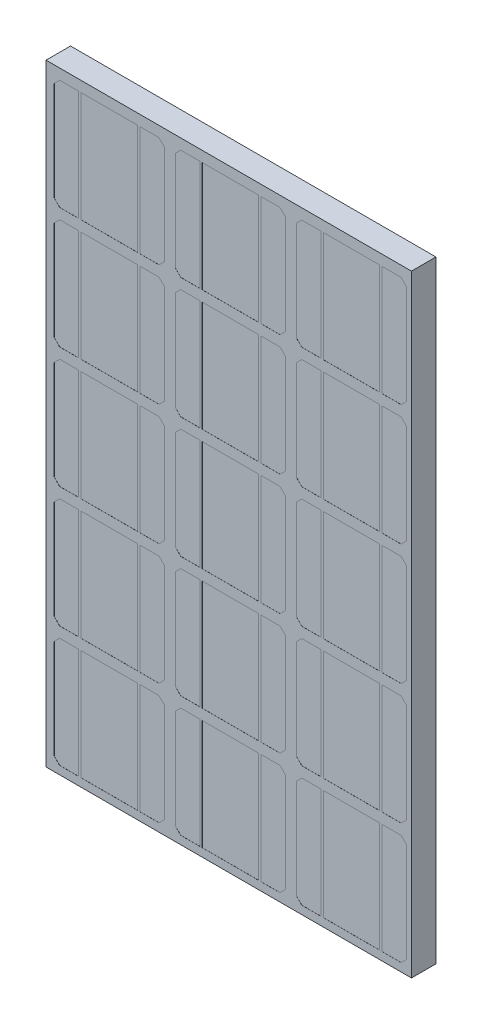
from build123d import *

# Parameters (mm, degrees)
ESQUISSE1_W             = 600
ESQUISSE1_H             = 750
BOSS_EXTRU_1_DEPTH      = 30
ESQUISSE2_W             = 69
ESQUISSE2_H             = 135
ENL_V_MAT_EXTRU_2_DEPTH = 0.1
SKETCH1_W               = 169.511093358
SKETCH1_H               = 791.762714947
CUT_EXTRUDE1_DEPTH      = 137


with BuildPart() as part:
    # Esquisse1 → Boss.-Extru.1 (new body)
    with BuildSketch(Plane.XY):
        with Locations((300, 375)):
            Rectangle(ESQUISSE1_W, ESQUISSE1_H)
    extrude(amount=BOSS_EXTRU_1_DEPTH)

    # Esquisse2 → Enl_v. mat.-Extru.2 (cut)
    with BuildSketch(Plane.XY.offset(30)):
        Polygon((138.324540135, 10), (115, 10), (115, 145), (138.324540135, 145), (145, 138.324540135), (145, 16.675459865), align=None)
        Polygon((40, 145), (40, 10), (16.675459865, 10), (10, 16.675459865), (10, 138.324540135), (16.675459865, 145), align=None)
        with Locations((77.5, 77.5)):
            Rectangle(ESQUISSE2_W, ESQUISSE2_H)
        with Locations((225.833333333, 77.5)):
            Rectangle(ESQUISSE2_W, ESQUISSE2_H)
        Polygon((286.657873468, 10), (263.333333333, 10), (263.333333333, 145), (286.657873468, 145), (293.333333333, 138.324540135), (293.333333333, 16.675459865), align=None)
        Polygon((188.333333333, 145), (188.333333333, 10), (165.008793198, 10), (158.333333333, 16.675459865), (158.333333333, 138.324540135), (165.008793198, 145), align=None)
        with Locations((374.166666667, 77.5)):
            Rectangle(ESQUISSE2_W, ESQUISSE2_H)
        Polygon((434.991206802, 10), (411.666666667, 10), (411.666666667, 145), (434.991206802, 145), (441.666666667, 138.324540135), (441.666666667, 16.675459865), align=None)
        Polygon((336.666666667, 145), (336.666666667, 10), (313.342126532, 10), (306.666666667, 16.675459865), (306.666666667, 138.324540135), (313.342126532, 145), align=None)
        with Locations((522.5, 77.5)):
            Rectangle(ESQUISSE2_W, ESQUISSE2_H)
        Polygon((583.324540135, 10), (560, 10), (560, 145), (583.324540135, 145), (590, 138.324540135), (590, 16.675459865), align=None)
        Polygon((485, 145), (485, 10), (461.675459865, 10), (455, 16.675459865), (455, 138.324540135), (461.675459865, 145), align=None)
        Polygon((40, 293), (40, 158), (16.675459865, 158), (10, 164.675459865), (10, 286.324540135), (16.675459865, 293), align=None)
        with Locations((77.5, 225.5)):
            Rectangle(ESQUISSE2_W, ESQUISSE2_H)
        Polygon((138.324540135, 158), (115, 158), (115, 293), (138.324540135, 293), (145, 286.324540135), (145, 164.675459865), align=None)
        Polygon((188.333333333, 293), (188.333333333, 158), (165.008793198, 158), (158.333333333, 164.675459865), (158.333333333, 286.324540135), (165.008793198, 293), align=None)
        with Locations((225.833333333, 225.5)):
            Rectangle(ESQUISSE2_W, ESQUISSE2_H)
        Polygon((286.657873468, 158), (263.333333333, 158), (263.333333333, 293), (286.657873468, 293), (293.333333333, 286.324540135), (293.333333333, 164.675459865), align=None)
        Polygon((336.666666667, 293), (336.666666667, 158), (313.342126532, 158), (306.666666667, 164.675459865), (306.666666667, 286.324540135), (313.342126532, 293), align=None)
        with Locations((374.166666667, 225.5)):
            Rectangle(ESQUISSE2_W, ESQUISSE2_H)
        Polygon((434.991206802, 158), (411.666666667, 158), (411.666666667, 293), (434.991206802, 293), (441.666666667, 286.324540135), (441.666666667, 164.675459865), align=None)
        Polygon((485, 293), (485, 158), (461.675459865, 158), (455, 164.675459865), (455, 286.324540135), (461.675459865, 293), align=None)
        with Locations((522.5, 225.5)):
            Rectangle(ESQUISSE2_W, ESQUISSE2_H)
        Polygon((583.324540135, 158), (560, 158), (560, 293), (583.324540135, 293), (590, 286.324540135), (590, 164.675459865), align=None)
        Polygon((40, 441), (40, 306), (16.675459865, 306), (10, 312.675459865), (10, 434.324540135), (16.675459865, 441), align=None)
        with Locations((77.5, 373.5)):
            Rectangle(ESQUISSE2_W, ESQUISSE2_H)
        Polygon((138.324540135, 306), (115, 306), (115, 441), (138.324540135, 441), (145, 434.324540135), (145, 312.675459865), align=None)
        Polygon((188.333333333, 441), (188.333333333, 306), (165.008793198, 306), (158.333333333, 312.675459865), (158.333333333, 434.324540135), (165.008793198, 441), align=None)
        with Locations((225.833333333, 373.5)):
            Rectangle(ESQUISSE2_W, ESQUISSE2_H)
        Polygon((286.657873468, 306), (263.333333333, 306), (263.333333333, 441), (286.657873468, 441), (293.333333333, 434.324540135), (293.333333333, 312.675459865), align=None)
        Polygon((336.666666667, 441), (336.666666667, 306), (313.342126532, 306), (306.666666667, 312.675459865), (306.666666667, 434.324540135), (313.342126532, 441), align=None)
        with Locations((374.166666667, 373.5)):
            Rectangle(ESQUISSE2_W, ESQUISSE2_H)
        Polygon((434.991206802, 306), (411.666666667, 306), (411.666666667, 441), (434.991206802, 441), (441.666666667, 434.324540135), (441.666666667, 312.675459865), align=None)
        Polygon((485, 441), (485, 306), (461.675459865, 306), (455, 312.675459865), (455, 434.324540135), (461.675459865, 441), align=None)
        with Locations((522.5, 373.5)):
            Rectangle(ESQUISSE2_W, ESQUISSE2_H)
        Polygon((583.324540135, 306), (560, 306), (560, 441), (583.324540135, 441), (590, 434.324540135), (590, 312.675459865), align=None)
        Polygon((40, 589), (40, 454), (16.675459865, 454), (10, 460.675459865), (10, 582.324540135), (16.675459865, 589), align=None)
        with Locations((77.5, 521.5)):
            Rectangle(ESQUISSE2_W, ESQUISSE2_H)
        Polygon((138.324540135, 454), (115, 454), (115, 589), (138.324540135, 589), (145, 582.324540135), (145, 460.675459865), align=None)
        Polygon((188.333333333, 589), (188.333333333, 454), (165.008793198, 454), (158.333333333, 460.675459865), (158.333333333, 582.324540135), (165.008793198, 589), align=None)
        with Locations((225.833333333, 521.5)):
            Rectangle(ESQUISSE2_W, ESQUISSE2_H)
        Polygon((286.657873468, 454), (263.333333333, 454), (263.333333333, 589), (286.657873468, 589), (293.333333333, 582.324540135), (293.333333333, 460.675459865), align=None)
        Polygon((336.666666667, 589), (336.666666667, 454), (313.342126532, 454), (306.666666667, 460.675459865), (306.666666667, 582.324540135), (313.342126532, 589), align=None)
        with Locations((374.166666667, 521.5)):
            Rectangle(ESQUISSE2_W, ESQUISSE2_H)
        Polygon((434.991206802, 454), (411.666666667, 454), (411.666666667, 589), (434.991206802, 589), (441.666666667, 582.324540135), (441.666666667, 460.675459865), align=None)
        Polygon((485, 589), (485, 454), (461.675459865, 454), (455, 460.675459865), (455, 582.324540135), (461.675459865, 589), align=None)
        with Locations((522.5, 521.5)):
            Rectangle(ESQUISSE2_W, ESQUISSE2_H)
        Polygon((583.324540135, 454), (560, 454), (560, 589), (583.324540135, 589), (590, 582.324540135), (590, 460.675459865), align=None)
        Polygon((40, 737), (40, 602), (16.675459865, 602), (10, 608.675459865), (10, 730.324540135), (16.675459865, 737), align=None)
        with Locations((77.5, 669.5)):
            Rectangle(ESQUISSE2_W, ESQUISSE2_H)
        Polygon((138.324540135, 602), (115, 602), (115, 737), (138.324540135, 737), (145, 730.324540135), (145, 608.675459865), align=None)
        Polygon((188.333333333, 737), (188.333333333, 602), (165.008793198, 602), (158.333333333, 608.675459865), (158.333333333, 730.324540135), (165.008793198, 737), align=None)
        with Locations((225.833333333, 669.5)):
            Rectangle(ESQUISSE2_W, ESQUISSE2_H)
        Polygon((286.657873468, 602), (263.333333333, 602), (263.333333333, 737), (286.657873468, 737), (293.333333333, 730.324540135), (293.333333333, 608.675459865), align=None)
        Polygon((336.666666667, 737), (336.666666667, 602), (313.342126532, 602), (306.666666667, 608.675459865), (306.666666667, 730.324540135), (313.342126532, 737), align=None)
        with Locations((374.166666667, 669.5)):
            Rectangle(ESQUISSE2_W, ESQUISSE2_H)
        Polygon((434.991206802, 602), (411.666666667, 602), (411.666666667, 737), (434.991206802, 737), (441.666666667, 730.324540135), (441.666666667, 608.675459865), align=None)
        Polygon((485, 737), (485, 602), (461.675459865, 602), (455, 608.675459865), (455, 730.324540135), (461.675459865, 737), align=None)
        with Locations((522.5, 669.5)):
            Rectangle(ESQUISSE2_W, ESQUISSE2_H)
        Polygon((583.324540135, 602), (560, 602), (560, 737), (583.324540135, 737), (590, 730.324540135), (590, 608.675459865), align=None)
    extrude(amount=-ENL_V_MAT_EXTRU_2_DEPTH, mode=Mode.SUBTRACT)

    # Sketch1 → Cut-Extrude1 (cut)
    with BuildSketch(Plane.XY.offset(30)):
        with Locations((532.434420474, 367.339216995)):
            Rectangle(SKETCH1_W, SKETCH1_H)
    extrude(amount=-CUT_EXTRUDE1_DEPTH, mode=Mode.SUBTRACT)


solid = part.part
